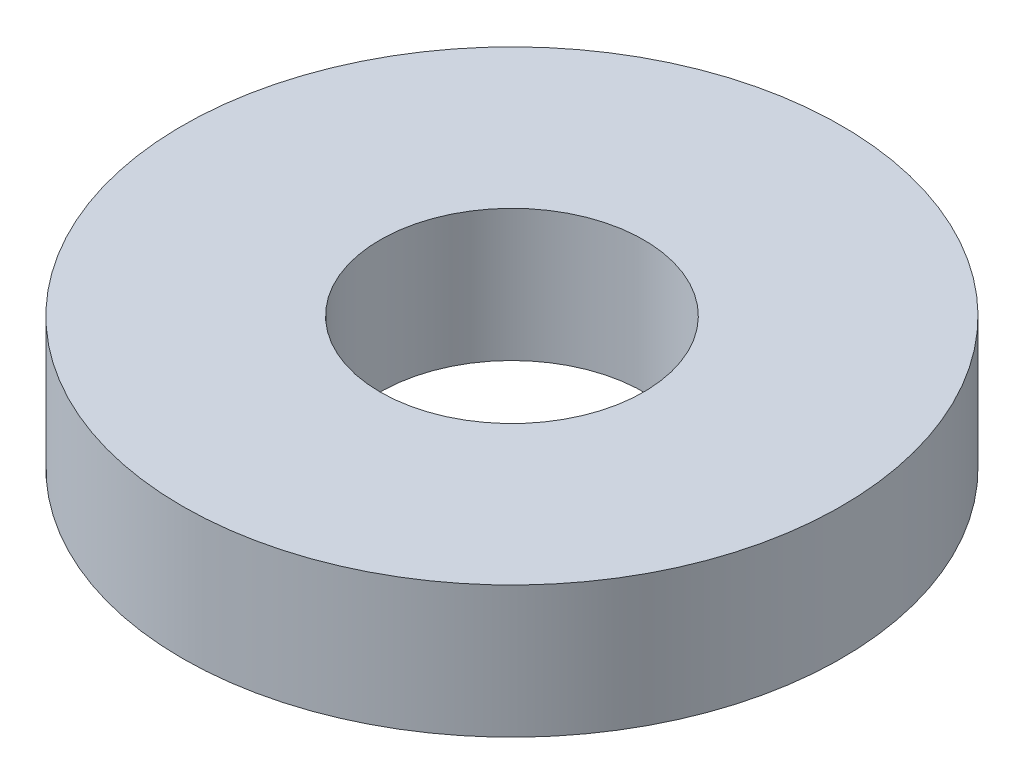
ISO-10303-21;
HEADER;
FILE_DESCRIPTION(('STEP AP214'),'2;1');
FILE_NAME('part.step','',(''),(''),'','','');
FILE_SCHEMA(('AUTOMOTIVE_DESIGN { 1 0 10303 214 1 1 1 1 }'));
ENDSEC;
DATA;
#1=APPLICATION_CONTEXT('core data for automotive mechanical design processes');
#2=APPLICATION_PROTOCOL_DEFINITION('international standard','automotive_design',2000,#1);
#3=PRODUCT_CONTEXT('',#1,'mechanical');
#4=PRODUCT('Part','Part','',(#3));
#5=PRODUCT_RELATED_PRODUCT_CATEGORY('part','',(#4));
#6=PRODUCT_DEFINITION_FORMATION('','',#4);
#7=PRODUCT_DEFINITION_CONTEXT('part definition',#1,'design');
#8=PRODUCT_DEFINITION('design','',#6,#7);
#9=PRODUCT_DEFINITION_SHAPE('','',#8);
#10=(LENGTH_UNIT() NAMED_UNIT(*) SI_UNIT(.MILLI.,.METRE.));
#11=(NAMED_UNIT(*) PLANE_ANGLE_UNIT() SI_UNIT($,.RADIAN.));
#12=(NAMED_UNIT(*) SI_UNIT($,.STERADIAN.) SOLID_ANGLE_UNIT());
#13=UNCERTAINTY_MEASURE_WITH_UNIT(LENGTH_MEASURE(1.E-05),#10,'distance_accuracy_value','');
#14=(GEOMETRIC_REPRESENTATION_CONTEXT(3) GLOBAL_UNCERTAINTY_ASSIGNED_CONTEXT((#13)) GLOBAL_UNIT_ASSIGNED_CONTEXT((#10,
#11,#12)) REPRESENTATION_CONTEXT('',''));
#15=CARTESIAN_POINT('',(0.,0.,0.));
#16=DIRECTION('',(0.,0.,1.));
#17=DIRECTION('',(1.,0.,0.));
#18=AXIS2_PLACEMENT_3D('',#15,#16,#17);
#19=CARTESIAN_POINT('',(0.,3.,0.));
#20=DIRECTION('',(0.,1.,0.));
#21=DIRECTION('',(0.,0.,1.));
#22=AXIS2_PLACEMENT_3D('',#19,#20,#21);
#23=PLANE('',#22);
#24=CARTESIAN_POINT('',(0.,3.,0.));
#25=DIRECTION('',(0.,1.,0.));
#26=DIRECTION('',(0.,0.,1.));
#27=AXIS2_PLACEMENT_3D('',#24,#25,#26);
#28=CIRCLE('',#27,7.5);
#29=CARTESIAN_POINT('',(0.,3.,7.5));
#30=VERTEX_POINT('',#29);
#31=EDGE_CURVE('E10',#30,#30,#28,.T.);
#32=ORIENTED_EDGE('',*,*,#31,.T.);
#33=EDGE_LOOP('',(#32));
#34=FACE_BOUND('',#33,.T.);
#35=CARTESIAN_POINT('',(0.,3.,0.));
#36=DIRECTION('',(0.,1.,0.));
#37=DIRECTION('',(0.,0.,1.));
#38=AXIS2_PLACEMENT_3D('',#35,#36,#37);
#39=CIRCLE('',#38,3.);
#40=CARTESIAN_POINT('',(0.,3.,3.));
#41=VERTEX_POINT('',#40);
#42=EDGE_CURVE('E40',#41,#41,#39,.T.);
#43=ORIENTED_EDGE('',*,*,#42,.F.);
#44=EDGE_LOOP('',(#43));
#45=FACE_BOUND('',#44,.T.);
#46=ADVANCED_FACE('F29',(#34,#45),#23,.T.);
#47=CARTESIAN_POINT('',(0.,0.,0.));
#48=DIRECTION('',(0.,1.,0.));
#49=DIRECTION('',(0.,0.,1.));
#50=AXIS2_PLACEMENT_3D('',#47,#48,#49);
#51=PLANE('',#50);
#52=CARTESIAN_POINT('',(0.,0.,0.));
#53=DIRECTION('',(0.,1.,0.));
#54=DIRECTION('',(0.,0.,1.));
#55=AXIS2_PLACEMENT_3D('',#52,#53,#54);
#56=CIRCLE('',#55,7.5);
#57=CARTESIAN_POINT('',(0.,0.,7.5));
#58=VERTEX_POINT('',#57);
#59=EDGE_CURVE('E33',#58,#58,#56,.T.);
#60=ORIENTED_EDGE('',*,*,#59,.F.);
#61=EDGE_LOOP('',(#60));
#62=FACE_BOUND('',#61,.T.);
#63=CARTESIAN_POINT('',(0.,0.,0.));
#64=DIRECTION('',(0.,1.,0.));
#65=DIRECTION('',(0.,0.,1.));
#66=AXIS2_PLACEMENT_3D('',#63,#64,#65);
#67=CIRCLE('',#66,3.);
#68=CARTESIAN_POINT('',(0.,0.,3.));
#69=VERTEX_POINT('',#68);
#70=EDGE_CURVE('E42',#69,#69,#67,.T.);
#71=ORIENTED_EDGE('',*,*,#70,.T.);
#72=EDGE_LOOP('',(#71));
#73=FACE_BOUND('',#72,.T.);
#74=ADVANCED_FACE('F52',(#62,#73),#51,.F.);
#75=CARTESIAN_POINT('',(0.,3.,0.));
#76=DIRECTION('',(0.,-1.,0.));
#77=DIRECTION('',(0.,0.,-1.));
#78=AXIS2_PLACEMENT_3D('',#75,#76,#77);
#79=CYLINDRICAL_SURFACE('',#78,7.5);
#80=ORIENTED_EDGE('',*,*,#31,.F.);
#81=EDGE_LOOP('',(#80));
#82=FACE_BOUND('',#81,.T.);
#83=ORIENTED_EDGE('',*,*,#59,.T.);
#84=EDGE_LOOP('',(#83));
#85=FACE_BOUND('',#84,.T.);
#86=ADVANCED_FACE('F31',(#82,#85),#79,.T.);
#87=CARTESIAN_POINT('',(0.,3.,0.));
#88=DIRECTION('',(0.,-1.,0.));
#89=DIRECTION('',(0.,0.,-1.));
#90=AXIS2_PLACEMENT_3D('',#87,#88,#89);
#91=CYLINDRICAL_SURFACE('',#90,3.);
#92=ORIENTED_EDGE('',*,*,#42,.T.);
#93=EDGE_LOOP('',(#92));
#94=FACE_BOUND('',#93,.T.);
#95=ORIENTED_EDGE('',*,*,#70,.F.);
#96=EDGE_LOOP('',(#95));
#97=FACE_BOUND('',#96,.T.);
#98=ADVANCED_FACE('F48',(#94,#97),#91,.F.);
#99=CLOSED_SHELL('',(#46,#74,#86,#98));
#100=MANIFOLD_SOLID_BREP('B2',#99);
#101=ADVANCED_BREP_SHAPE_REPRESENTATION('',(#18,#100),#14);
#102=SHAPE_DEFINITION_REPRESENTATION(#9,#101);
ENDSEC;
END-ISO-10303-21;
